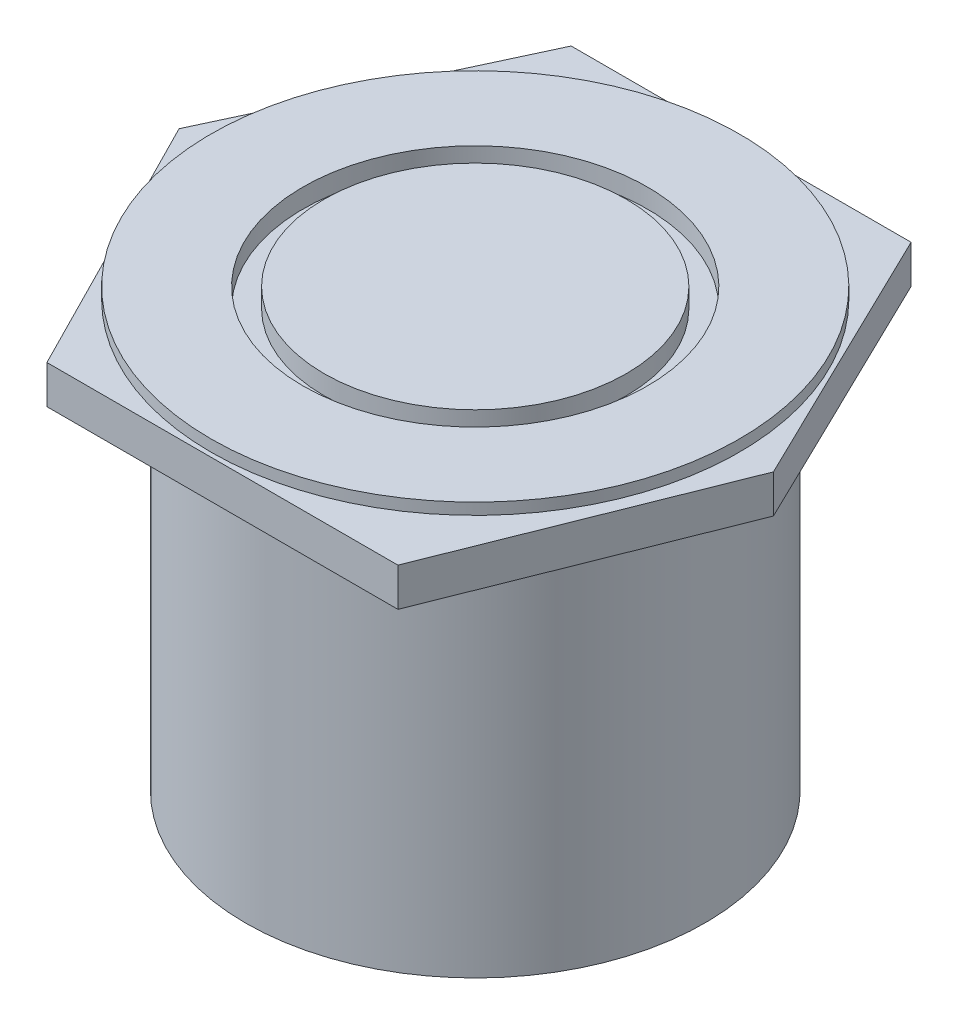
ISO-10303-21;
HEADER;
FILE_DESCRIPTION(('STEP AP214'),'2;1');
FILE_NAME('part.step','',(''),(''),'','','');
FILE_SCHEMA(('AUTOMOTIVE_DESIGN { 1 0 10303 214 1 1 1 1 }'));
ENDSEC;
DATA;
#1=APPLICATION_CONTEXT('core data for automotive mechanical design processes');
#2=APPLICATION_PROTOCOL_DEFINITION('international standard','automotive_design',2000,#1);
#3=PRODUCT_CONTEXT('',#1,'mechanical');
#4=PRODUCT('Part','Part','',(#3));
#5=PRODUCT_RELATED_PRODUCT_CATEGORY('part','',(#4));
#6=PRODUCT_DEFINITION_FORMATION('','',#4);
#7=PRODUCT_DEFINITION_CONTEXT('part definition',#1,'design');
#8=PRODUCT_DEFINITION('design','',#6,#7);
#9=PRODUCT_DEFINITION_SHAPE('','',#8);
#10=(LENGTH_UNIT() NAMED_UNIT(*) SI_UNIT(.MILLI.,.METRE.));
#11=(NAMED_UNIT(*) PLANE_ANGLE_UNIT() SI_UNIT($,.RADIAN.));
#12=(NAMED_UNIT(*) SI_UNIT($,.STERADIAN.) SOLID_ANGLE_UNIT());
#13=UNCERTAINTY_MEASURE_WITH_UNIT(LENGTH_MEASURE(1.E-05),#10,'distance_accuracy_value','');
#14=(GEOMETRIC_REPRESENTATION_CONTEXT(3) GLOBAL_UNCERTAINTY_ASSIGNED_CONTEXT((#13)) GLOBAL_UNIT_ASSIGNED_CONTEXT((#10,
#11,#12)) REPRESENTATION_CONTEXT('',''));
#15=CARTESIAN_POINT('',(0.,0.,0.));
#16=DIRECTION('',(0.,0.,1.));
#17=DIRECTION('',(1.,0.,0.));
#18=AXIS2_PLACEMENT_3D('',#15,#16,#17);
#19=CARTESIAN_POINT('',(0.,11.4,0.));
#20=DIRECTION('',(0.,-1.,0.));
#21=DIRECTION('',(0.,0.,-1.));
#22=AXIS2_PLACEMENT_3D('',#19,#20,#21);
#23=CYLINDRICAL_SURFACE('',#22,6.);
#24=CARTESIAN_POINT('',(0.,0.,0.));
#25=DIRECTION('',(0.,1.,0.));
#26=DIRECTION('',(0.,0.,1.));
#27=AXIS2_PLACEMENT_3D('',#24,#25,#26);
#28=CIRCLE('',#27,6.);
#29=CARTESIAN_POINT('',(0.,0.,6.));
#30=VERTEX_POINT('',#29);
#31=EDGE_CURVE('E180',#30,#30,#28,.T.);
#32=ORIENTED_EDGE('',*,*,#31,.T.);
#33=EDGE_LOOP('',(#32));
#34=FACE_BOUND('',#33,.T.);
#35=CARTESIAN_POINT('',(0.,10.1,0.));
#36=DIRECTION('',(0.,1.,0.));
#37=DIRECTION('',(0.,0.,1.));
#38=AXIS2_PLACEMENT_3D('',#35,#36,#37);
#39=CIRCLE('',#38,6.);
#40=CARTESIAN_POINT('',(0.,10.1,6.));
#41=VERTEX_POINT('',#40);
#42=EDGE_CURVE('E11',#41,#41,#39,.T.);
#43=ORIENTED_EDGE('',*,*,#42,.F.);
#44=EDGE_LOOP('',(#43));
#45=FACE_BOUND('',#44,.T.);
#46=ADVANCED_FACE('F33',(#34,#45),#23,.T.);
#47=CARTESIAN_POINT('',(0.,0.,0.));
#48=DIRECTION('',(0.,1.,0.));
#49=DIRECTION('',(0.,0.,1.));
#50=AXIS2_PLACEMENT_3D('',#47,#48,#49);
#51=PLANE('',#50);
#52=ORIENTED_EDGE('',*,*,#31,.F.);
#53=EDGE_LOOP('',(#52));
#54=FACE_BOUND('',#53,.T.);
#55=ADVANCED_FACE('F208',(#54),#51,.F.);
#56=CARTESIAN_POINT('',(7.78800940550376,10.1,0.));
#57=DIRECTION('',(0.899516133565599,0.,-0.436887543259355));
#58=DIRECTION('',(-0.436887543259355,0.,-0.899516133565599));
#59=AXIS2_PLACEMENT_3D('',#56,#57,#58);
#60=PLANE('',#59);
#61=DIRECTION('',(-0.436887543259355,0.,-0.899516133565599));
#62=VECTOR('',#61,1.);
#63=CARTESIAN_POINT('',(7.78800940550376,11.1,0.));
#64=LINE('',#63,#62);
#65=CARTESIAN_POINT('',(7.78800940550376,11.1,0.));
#66=VERTEX_POINT('',#65);
#67=CARTESIAN_POINT('',(4.39227969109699,11.1,-6.99153297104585));
#68=VERTEX_POINT('',#67);
#69=EDGE_CURVE('E144',#66,#68,#64,.T.);
#70=ORIENTED_EDGE('',*,*,#69,.F.);
#71=DIRECTION('',(0.,1.,0.));
#72=VECTOR('',#71,1.);
#73=CARTESIAN_POINT('',(7.78800940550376,10.1,0.));
#74=LINE('',#73,#72);
#75=CARTESIAN_POINT('',(7.78800940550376,10.1,0.));
#76=VERTEX_POINT('',#75);
#77=EDGE_CURVE('E126',#76,#66,#74,.T.);
#78=ORIENTED_EDGE('',*,*,#77,.F.);
#79=DIRECTION('',(-0.436887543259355,0.,-0.899516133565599));
#80=VECTOR('',#79,1.);
#81=CARTESIAN_POINT('',(7.78800940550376,10.1,0.));
#82=LINE('',#81,#80);
#83=CARTESIAN_POINT('',(4.39227969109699,10.1,-6.99153297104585));
#84=VERTEX_POINT('',#83);
#85=EDGE_CURVE('E119',#76,#84,#82,.T.);
#86=ORIENTED_EDGE('',*,*,#85,.T.);
#87=DIRECTION('',(0.,1.,0.));
#88=VECTOR('',#87,1.);
#89=CARTESIAN_POINT('',(4.39227969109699,10.1,-6.99153297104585));
#90=LINE('',#89,#88);
#91=EDGE_CURVE('E101',#84,#68,#90,.T.);
#92=ORIENTED_EDGE('',*,*,#91,.T.);
#93=EDGE_LOOP('',(#70,#78,#86,#92));
#94=FACE_BOUND('',#93,.T.);
#95=ADVANCED_FACE('F125',(#94),#60,.T.);
#96=CARTESIAN_POINT('',(4.99418094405,10.1,7.01332391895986));
#97=DIRECTION('',(0.929001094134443,0.,0.370076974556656));
#98=DIRECTION('',(0.370076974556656,0.,-0.929001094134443));
#99=AXIS2_PLACEMENT_3D('',#96,#97,#98);
#100=PLANE('',#99);
#101=DIRECTION('',(0.370076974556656,0.,-0.929001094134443));
#102=VECTOR('',#101,1.);
#103=CARTESIAN_POINT('',(4.99418094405,11.1,7.01332391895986));
#104=LINE('',#103,#102);
#105=CARTESIAN_POINT('',(4.99418094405,11.1,7.01332391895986));
#106=VERTEX_POINT('',#105);
#107=EDGE_CURVE('E127',#106,#66,#104,.T.);
#108=ORIENTED_EDGE('',*,*,#107,.F.);
#109=DIRECTION('',(0.,1.,0.));
#110=VECTOR('',#109,1.);
#111=CARTESIAN_POINT('',(4.99418094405,10.1,7.01332391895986));
#112=LINE('',#111,#110);
#113=CARTESIAN_POINT('',(4.99418094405,10.1,7.01332391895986));
#114=VERTEX_POINT('',#113);
#115=EDGE_CURVE('E159',#114,#106,#112,.T.);
#116=ORIENTED_EDGE('',*,*,#115,.F.);
#117=DIRECTION('',(0.370076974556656,0.,-0.929001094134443));
#118=VECTOR('',#117,1.);
#119=CARTESIAN_POINT('',(4.99418094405,10.1,7.01332391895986));
#120=LINE('',#119,#118);
#121=EDGE_CURVE('E112',#114,#76,#120,.T.);
#122=ORIENTED_EDGE('',*,*,#121,.T.);
#123=ORIENTED_EDGE('',*,*,#77,.T.);
#124=EDGE_LOOP('',(#108,#116,#122,#123));
#125=FACE_BOUND('',#124,.T.);
#126=ADVANCED_FACE('F200',(#125),#100,.T.);
#127=CARTESIAN_POINT('',(-4.17308180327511,10.1,7.01332391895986));
#128=DIRECTION('',(0.,0.,1.));
#129=DIRECTION('',(1.,0.,0.));
#130=AXIS2_PLACEMENT_3D('',#127,#128,#129);
#131=PLANE('',#130);
#132=DIRECTION('',(1.,0.,0.));
#133=VECTOR('',#132,1.);
#134=CARTESIAN_POINT('',(-4.17308180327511,11.1,7.01332391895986));
#135=LINE('',#134,#133);
#136=CARTESIAN_POINT('',(-4.17308180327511,11.1,7.01332391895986));
#137=VERTEX_POINT('',#136);
#138=EDGE_CURVE('E130',#137,#106,#135,.T.);
#139=ORIENTED_EDGE('',*,*,#138,.F.);
#140=DIRECTION('',(0.,1.,0.));
#141=VECTOR('',#140,1.);
#142=CARTESIAN_POINT('',(-4.17308180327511,10.1,7.01332391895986));
#143=LINE('',#142,#141);
#144=CARTESIAN_POINT('',(-4.17308180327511,10.1,7.01332391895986));
#145=VERTEX_POINT('',#144);
#146=EDGE_CURVE('E161',#145,#137,#143,.T.);
#147=ORIENTED_EDGE('',*,*,#146,.F.);
#148=DIRECTION('',(1.,0.,0.));
#149=VECTOR('',#148,1.);
#150=CARTESIAN_POINT('',(-4.17308180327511,10.1,7.01332391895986));
#151=LINE('',#150,#149);
#152=EDGE_CURVE('E140',#145,#114,#151,.T.);
#153=ORIENTED_EDGE('',*,*,#152,.T.);
#154=ORIENTED_EDGE('',*,*,#115,.T.);
#155=EDGE_LOOP('',(#139,#147,#153,#154));
#156=FACE_BOUND('',#155,.T.);
#157=ADVANCED_FACE('F197',(#156),#131,.T.);
#158=CARTESIAN_POINT('',(-7.73505819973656,10.1,0.));
#159=DIRECTION('',(-0.891596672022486,0.,0.452830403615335));
#160=DIRECTION('',(0.452830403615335,0.,0.891596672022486));
#161=AXIS2_PLACEMENT_3D('',#158,#159,#160);
#162=PLANE('',#161);
#163=DIRECTION('',(0.452830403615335,0.,0.891596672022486));
#164=VECTOR('',#163,1.);
#165=CARTESIAN_POINT('',(-7.73505819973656,11.1,0.));
#166=LINE('',#165,#164);
#167=CARTESIAN_POINT('',(-6.05017975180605,11.1,3.31742746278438));
#168=VERTEX_POINT('',#167);
#169=EDGE_CURVE('E151',#168,#137,#166,.T.);
#170=ORIENTED_EDGE('',*,*,#169,.F.);
#171=DIRECTION('',(0.,1.,0.));
#172=VECTOR('',#171,1.);
#173=CARTESIAN_POINT('',(-6.05017975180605,10.4,3.31742746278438));
#174=LINE('',#173,#172);
#175=CARTESIAN_POINT('',(-6.05017975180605,10.4,3.31742746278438));
#176=VERTEX_POINT('',#175);
#177=EDGE_CURVE('E51',#168,#176,#174,.F.);
#178=ORIENTED_EDGE('',*,*,#177,.T.);
#179=CARTESIAN_POINT('',(0.,10.4,0.));
#180=DIRECTION('',(0.,1.,0.));
#181=DIRECTION('',(-0.905464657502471,0.,0.424421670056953));
#182=AXIS2_PLACEMENT_3D('',#179,#180,#181);
#183=CIRCLE('',#182,6.9);
#184=CARTESIAN_POINT('',(-6.24770613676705,10.4,2.92850952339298));
#185=VERTEX_POINT('',#184);
#186=EDGE_CURVE('E55',#185,#176,#183,.T.);
#187=ORIENTED_EDGE('',*,*,#186,.F.);
#188=DIRECTION('',(0.,1.,0.));
#189=VECTOR('',#188,1.);
#190=CARTESIAN_POINT('',(-6.24770613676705,10.4,2.92850952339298));
#191=LINE('',#190,#189);
#192=CARTESIAN_POINT('',(-6.24770613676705,11.1,2.92850952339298));
#193=VERTEX_POINT('',#192);
#194=EDGE_CURVE('E158',#185,#193,#191,.T.);
#195=ORIENTED_EDGE('',*,*,#194,.T.);
#196=CARTESIAN_POINT('',(-7.73505819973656,11.1,0.));
#197=VERTEX_POINT('',#196);
#198=EDGE_CURVE('E152',#197,#193,#166,.T.);
#199=ORIENTED_EDGE('',*,*,#198,.F.);
#200=DIRECTION('',(0.,1.,0.));
#201=VECTOR('',#200,1.);
#202=CARTESIAN_POINT('',(-7.73505819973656,10.1,0.));
#203=LINE('',#202,#201);
#204=CARTESIAN_POINT('',(-7.73505819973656,10.1,0.));
#205=VERTEX_POINT('',#204);
#206=EDGE_CURVE('E164',#205,#197,#203,.T.);
#207=ORIENTED_EDGE('',*,*,#206,.F.);
#208=DIRECTION('',(0.452830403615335,0.,0.891596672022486));
#209=VECTOR('',#208,1.);
#210=CARTESIAN_POINT('',(-7.73505819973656,10.1,0.));
#211=LINE('',#210,#209);
#212=EDGE_CURVE('E137',#205,#145,#211,.T.);
#213=ORIENTED_EDGE('',*,*,#212,.T.);
#214=ORIENTED_EDGE('',*,*,#146,.T.);
#215=EDGE_LOOP('',(#170,#178,#187,#195,#199,#207,#213,#214));
#216=FACE_BOUND('',#215,.T.);
#217=ADVANCED_FACE('F188',(#216),#162,.T.);
#218=CARTESIAN_POINT('',(-4.48538041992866,10.1,-6.99153297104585));
#219=DIRECTION('',(-0.906830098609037,0.,-0.421496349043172));
#220=DIRECTION('',(-0.421496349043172,0.,0.906830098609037));
#221=AXIS2_PLACEMENT_3D('',#218,#219,#220);
#222=PLANE('',#221);
#223=DIRECTION('',(-0.421496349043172,0.,0.906830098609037));
#224=VECTOR('',#223,1.);
#225=CARTESIAN_POINT('',(-4.48538041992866,11.1,-6.99153297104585));
#226=LINE('',#225,#224);
#227=CARTESIAN_POINT('',(-4.48538041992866,11.1,-6.99153297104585));
#228=VERTEX_POINT('',#227);
#229=EDGE_CURVE('E148',#228,#197,#226,.T.);
#230=ORIENTED_EDGE('',*,*,#229,.F.);
#231=DIRECTION('',(0.,1.,0.));
#232=VECTOR('',#231,1.);
#233=CARTESIAN_POINT('',(-4.48538041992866,10.1,-6.99153297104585));
#234=LINE('',#233,#232);
#235=CARTESIAN_POINT('',(-4.48538041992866,10.1,-6.99153297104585));
#236=VERTEX_POINT('',#235);
#237=EDGE_CURVE('E111',#236,#228,#234,.T.);
#238=ORIENTED_EDGE('',*,*,#237,.F.);
#239=DIRECTION('',(-0.421496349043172,0.,0.906830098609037));
#240=VECTOR('',#239,1.);
#241=CARTESIAN_POINT('',(-4.48538041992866,10.1,-6.99153297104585));
#242=LINE('',#241,#240);
#243=EDGE_CURVE('E123',#236,#205,#242,.T.);
#244=ORIENTED_EDGE('',*,*,#243,.T.);
#245=ORIENTED_EDGE('',*,*,#206,.T.);
#246=EDGE_LOOP('',(#230,#238,#244,#245));
#247=FACE_BOUND('',#246,.T.);
#248=ADVANCED_FACE('F193',(#247),#222,.T.);
#249=CARTESIAN_POINT('',(4.39227969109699,10.1,-6.99153297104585));
#250=DIRECTION('',(0.,0.,-1.));
#251=DIRECTION('',(-1.,0.,0.));
#252=AXIS2_PLACEMENT_3D('',#249,#250,#251);
#253=PLANE('',#252);
#254=DIRECTION('',(-1.,0.,0.));
#255=VECTOR('',#254,1.);
#256=CARTESIAN_POINT('',(4.39227969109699,11.1,-6.99153297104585));
#257=LINE('',#256,#255);
#258=EDGE_CURVE('E106',#68,#228,#257,.T.);
#259=ORIENTED_EDGE('',*,*,#258,.F.);
#260=ORIENTED_EDGE('',*,*,#91,.F.);
#261=DIRECTION('',(-1.,0.,0.));
#262=VECTOR('',#261,1.);
#263=CARTESIAN_POINT('',(4.39227969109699,10.1,-6.99153297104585));
#264=LINE('',#263,#262);
#265=EDGE_CURVE('E104',#84,#236,#264,.T.);
#266=ORIENTED_EDGE('',*,*,#265,.T.);
#267=ORIENTED_EDGE('',*,*,#237,.T.);
#268=EDGE_LOOP('',(#259,#260,#266,#267));
#269=FACE_BOUND('',#268,.T.);
#270=ADVANCED_FACE('F103',(#269),#253,.T.);
#271=CARTESIAN_POINT('',(0.,10.1,0.));
#272=DIRECTION('',(0.,1.,0.));
#273=DIRECTION('',(0.,0.,1.));
#274=AXIS2_PLACEMENT_3D('',#271,#272,#273);
#275=PLANE('',#274);
#276=ORIENTED_EDGE('',*,*,#42,.T.);
#277=EDGE_LOOP('',(#276));
#278=FACE_BOUND('',#277,.T.);
#279=ORIENTED_EDGE('',*,*,#85,.F.);
#280=ORIENTED_EDGE('',*,*,#121,.F.);
#281=ORIENTED_EDGE('',*,*,#152,.F.);
#282=ORIENTED_EDGE('',*,*,#212,.F.);
#283=ORIENTED_EDGE('',*,*,#243,.F.);
#284=ORIENTED_EDGE('',*,*,#265,.F.);
#285=EDGE_LOOP('',(#279,#280,#281,#282,#283,#284));
#286=FACE_BOUND('',#285,.T.);
#287=ADVANCED_FACE('F117',(#278,#286),#275,.F.);
#288=CARTESIAN_POINT('',(0.,11.1,0.));
#289=DIRECTION('',(0.,1.,0.));
#290=DIRECTION('',(0.,0.,1.));
#291=AXIS2_PLACEMENT_3D('',#288,#289,#290);
#292=PLANE('',#291);
#293=ORIENTED_EDGE('',*,*,#198,.T.);
#294=CARTESIAN_POINT('',(0.,11.1,0.));
#295=DIRECTION('',(0.,1.,0.));
#296=DIRECTION('',(0.,0.,1.));
#297=AXIS2_PLACEMENT_3D('',#294,#295,#296);
#298=CIRCLE('',#297,6.9);
#299=EDGE_CURVE('E43',#193,#168,#298,.F.);
#300=ORIENTED_EDGE('',*,*,#299,.T.);
#301=ORIENTED_EDGE('',*,*,#169,.T.);
#302=ORIENTED_EDGE('',*,*,#138,.T.);
#303=ORIENTED_EDGE('',*,*,#107,.T.);
#304=ORIENTED_EDGE('',*,*,#69,.T.);
#305=ORIENTED_EDGE('',*,*,#258,.T.);
#306=ORIENTED_EDGE('',*,*,#229,.T.);
#307=EDGE_LOOP('',(#293,#300,#301,#302,#303,#304,#305,#306));
#308=FACE_BOUND('',#307,.T.);
#309=ADVANCED_FACE('F190',(#308),#292,.T.);
#310=CARTESIAN_POINT('',(0.,11.4,0.));
#311=DIRECTION('',(0.,1.,0.));
#312=DIRECTION('',(0.,0.,1.));
#313=AXIS2_PLACEMENT_3D('',#310,#311,#312);
#314=PLANE('',#313);
#315=CARTESIAN_POINT('',(0.,11.4,0.));
#316=DIRECTION('',(0.,1.,0.));
#317=DIRECTION('',(0.,0.,1.));
#318=AXIS2_PLACEMENT_3D('',#315,#316,#317);
#319=CIRCLE('',#318,4.5);
#320=CARTESIAN_POINT('',(0.,11.4,4.5));
#321=VERTEX_POINT('',#320);
#322=EDGE_CURVE('E133',#321,#321,#319,.T.);
#323=ORIENTED_EDGE('',*,*,#322,.F.);
#324=EDGE_LOOP('',(#323));
#325=FACE_BOUND('',#324,.T.);
#326=CARTESIAN_POINT('',(0.,11.4,0.));
#327=DIRECTION('',(0.,1.,0.));
#328=DIRECTION('',(0.,0.,1.));
#329=AXIS2_PLACEMENT_3D('',#326,#327,#328);
#330=CIRCLE('',#329,6.9);
#331=CARTESIAN_POINT('',(0.,11.4,6.9));
#332=VERTEX_POINT('',#331);
#333=EDGE_CURVE('E177',#332,#332,#330,.T.);
#334=ORIENTED_EDGE('',*,*,#333,.T.);
#335=EDGE_LOOP('',(#334));
#336=FACE_BOUND('',#335,.T.);
#337=ADVANCED_FACE('F227',(#325,#336),#314,.T.);
#338=CARTESIAN_POINT('',(0.,10.4,0.));
#339=DIRECTION('',(0.,1.,0.));
#340=DIRECTION('',(0.,0.,1.));
#341=AXIS2_PLACEMENT_3D('',#338,#339,#340);
#342=CYLINDRICAL_SURFACE('',#341,6.9);
#343=ORIENTED_EDGE('',*,*,#177,.F.);
#344=ORIENTED_EDGE('',*,*,#299,.F.);
#345=ORIENTED_EDGE('',*,*,#194,.F.);
#346=ORIENTED_EDGE('',*,*,#186,.T.);
#347=EDGE_LOOP('',(#343,#344,#345,#346));
#348=FACE_BOUND('',#347,.T.);
#349=ORIENTED_EDGE('',*,*,#333,.F.);
#350=EDGE_LOOP('',(#349));
#351=FACE_BOUND('',#350,.T.);
#352=ADVANCED_FACE('F184',(#348,#351),#342,.T.);
#353=CARTESIAN_POINT('',(0.,10.9,0.));
#354=DIRECTION('',(0.,1.,0.));
#355=DIRECTION('',(0.,0.,1.));
#356=AXIS2_PLACEMENT_3D('',#353,#354,#355);
#357=CYLINDRICAL_SURFACE('',#356,4.5);
#358=CARTESIAN_POINT('',(0.,10.9,0.));
#359=DIRECTION('',(0.,1.,0.));
#360=DIRECTION('',(0.,0.,1.));
#361=AXIS2_PLACEMENT_3D('',#358,#359,#360);
#362=CIRCLE('',#361,4.5);
#363=CARTESIAN_POINT('',(0.,10.9,4.5));
#364=VERTEX_POINT('',#363);
#365=EDGE_CURVE('E146',#364,#364,#362,.T.);
#366=ORIENTED_EDGE('',*,*,#365,.F.);
#367=EDGE_LOOP('',(#366));
#368=FACE_BOUND('',#367,.T.);
#369=ORIENTED_EDGE('',*,*,#322,.T.);
#370=EDGE_LOOP('',(#369));
#371=FACE_BOUND('',#370,.T.);
#372=ADVANCED_FACE('F230',(#368,#371),#357,.F.);
#373=CARTESIAN_POINT('',(0.,10.9,0.));
#374=DIRECTION('',(0.,1.,0.));
#375=DIRECTION('',(0.,0.,1.));
#376=AXIS2_PLACEMENT_3D('',#373,#374,#375);
#377=PLANE('',#376);
#378=CARTESIAN_POINT('',(0.,10.9,0.));
#379=DIRECTION('',(0.,1.,0.));
#380=DIRECTION('',(0.,0.,1.));
#381=AXIS2_PLACEMENT_3D('',#378,#379,#380);
#382=CIRCLE('',#381,3.94637402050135);
#383=CARTESIAN_POINT('',(0.,10.9,3.94637402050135));
#384=VERTEX_POINT('',#383);
#385=EDGE_CURVE('E250',#384,#384,#382,.T.);
#386=ORIENTED_EDGE('',*,*,#385,.F.);
#387=EDGE_LOOP('',(#386));
#388=FACE_BOUND('',#387,.T.);
#389=ORIENTED_EDGE('',*,*,#365,.T.);
#390=EDGE_LOOP('',(#389));
#391=FACE_BOUND('',#390,.T.);
#392=ADVANCED_FACE('F233',(#388,#391),#377,.T.);
#393=CARTESIAN_POINT('',(0.,10.9,0.));
#394=DIRECTION('',(0.,1.,0.));
#395=DIRECTION('',(0.,0.,1.));
#396=AXIS2_PLACEMENT_3D('',#393,#394,#395);
#397=CYLINDRICAL_SURFACE('',#396,3.94637402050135);
#398=ORIENTED_EDGE('',*,*,#385,.T.);
#399=EDGE_LOOP('',(#398));
#400=FACE_BOUND('',#399,.T.);
#401=CARTESIAN_POINT('',(0.,11.4,0.));
#402=DIRECTION('',(0.,1.,0.));
#403=DIRECTION('',(0.,0.,1.));
#404=AXIS2_PLACEMENT_3D('',#401,#402,#403);
#405=CIRCLE('',#404,3.94637402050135);
#406=CARTESIAN_POINT('',(0.,11.4,3.94637402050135));
#407=VERTEX_POINT('',#406);
#408=EDGE_CURVE('E253',#407,#407,#405,.T.);
#409=ORIENTED_EDGE('',*,*,#408,.F.);
#410=EDGE_LOOP('',(#409));
#411=FACE_BOUND('',#410,.T.);
#412=ADVANCED_FACE('F237',(#400,#411),#397,.T.);
#413=ORIENTED_EDGE('',*,*,#408,.T.);
#414=EDGE_LOOP('',(#413));
#415=FACE_BOUND('',#414,.T.);
#416=ADVANCED_FACE('F240',(#415),#314,.T.);
#417=CLOSED_SHELL('',(#46,#55,#95,#126,#157,#217,#248,#270,#287,#309,#337,#352,#372,#392,#412,#416));
#418=MANIFOLD_SOLID_BREP('B2',#417);
#419=ADVANCED_BREP_SHAPE_REPRESENTATION('',(#18,#418),#14);
#420=SHAPE_DEFINITION_REPRESENTATION(#9,#419);
ENDSEC;
END-ISO-10303-21;
